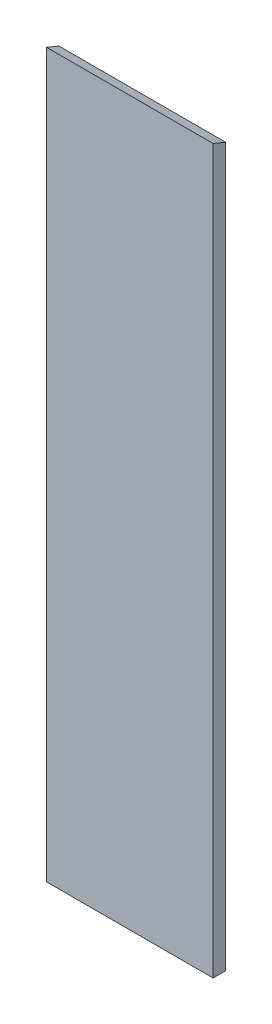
from build123d import *

# Parameters (mm, degrees)
ESQUISSE1_W             = 200
ESQUISSE1_H             = 867.16
BOSS_EXTRU_1_DEPTH      = 15
ENL_V_MAT_EXTRU_1_DEPTH = 478.720228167


with BuildPart() as part:
    # Esquisse1 → Boss.-Extru.1 (new body)
    with BuildSketch(Plane.XY):
        Rectangle(ESQUISSE1_W, ESQUISSE1_H)
    extrude(amount=BOSS_EXTRU_1_DEPTH)

    # Esquisse2 → Enl_v. mat.-Extru.1 (cut, through all)
    with BuildSketch(Plane(origin=(100, 0, 0), x_dir=(0, 0, -1), z_dir=(1, 0, 0))):
        Polygon((-15, 433.58), (0, 427.366796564), (0, 433.58), align=None)
    extrude(amount=-ENL_V_MAT_EXTRU_1_DEPTH, mode=Mode.SUBTRACT)


solid = part.part
